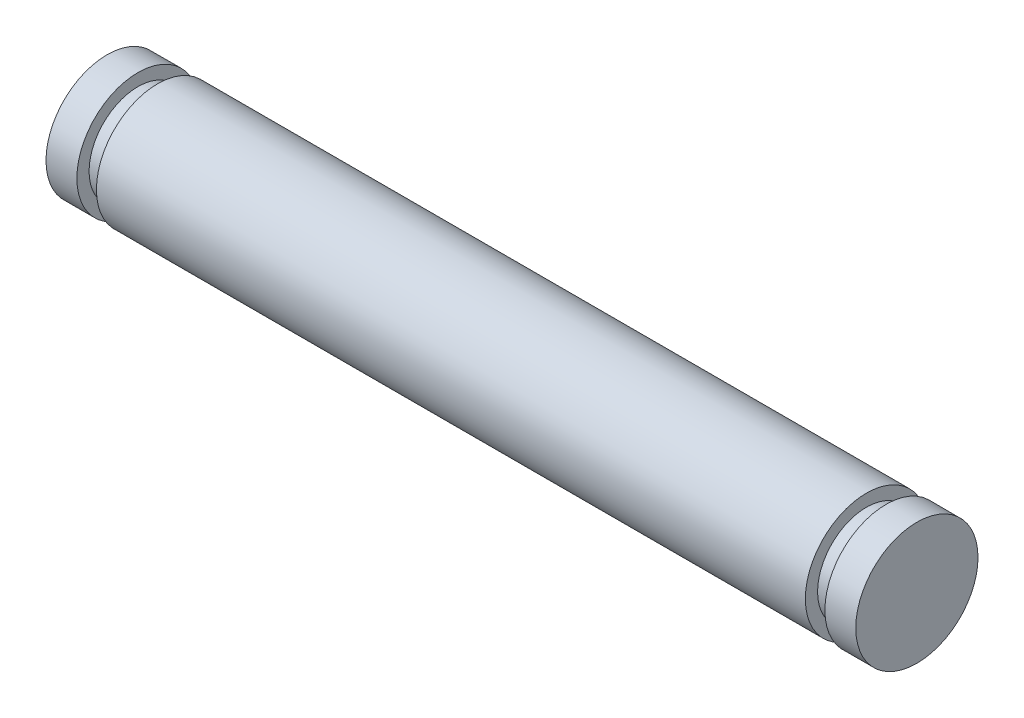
ISO-10303-21;
HEADER;
FILE_DESCRIPTION(('STEP AP214'),'2;1');
FILE_NAME('part.step','',(''),(''),'','','');
FILE_SCHEMA(('AUTOMOTIVE_DESIGN { 1 0 10303 214 1 1 1 1 }'));
ENDSEC;
DATA;
#1=APPLICATION_CONTEXT('core data for automotive mechanical design processes');
#2=APPLICATION_PROTOCOL_DEFINITION('international standard','automotive_design',2000,#1);
#3=PRODUCT_CONTEXT('',#1,'mechanical');
#4=PRODUCT('Part','Part','',(#3));
#5=PRODUCT_RELATED_PRODUCT_CATEGORY('part','',(#4));
#6=PRODUCT_DEFINITION_FORMATION('','',#4);
#7=PRODUCT_DEFINITION_CONTEXT('part definition',#1,'design');
#8=PRODUCT_DEFINITION('design','',#6,#7);
#9=PRODUCT_DEFINITION_SHAPE('','',#8);
#10=(LENGTH_UNIT() NAMED_UNIT(*) SI_UNIT(.MILLI.,.METRE.));
#11=(NAMED_UNIT(*) PLANE_ANGLE_UNIT() SI_UNIT($,.RADIAN.));
#12=(NAMED_UNIT(*) SI_UNIT($,.STERADIAN.) SOLID_ANGLE_UNIT());
#13=UNCERTAINTY_MEASURE_WITH_UNIT(LENGTH_MEASURE(1.E-05),#10,'distance_accuracy_value','');
#14=(GEOMETRIC_REPRESENTATION_CONTEXT(3) GLOBAL_UNCERTAINTY_ASSIGNED_CONTEXT((#13)) GLOBAL_UNIT_ASSIGNED_CONTEXT((#10,
#11,#12)) REPRESENTATION_CONTEXT('',''));
#15=CARTESIAN_POINT('',(0.,0.,0.));
#16=DIRECTION('',(0.,0.,1.));
#17=DIRECTION('',(1.,0.,0.));
#18=AXIS2_PLACEMENT_3D('',#15,#16,#17);
#19=CARTESIAN_POINT('',(13.25,0.,0.));
#20=DIRECTION('',(-1.,0.,0.));
#21=DIRECTION('',(0.,0.,1.));
#22=AXIS2_PLACEMENT_3D('',#19,#20,#21);
#23=CYLINDRICAL_SURFACE('',#22,2.);
#24=CARTESIAN_POINT('',(-11.6,0.,0.));
#25=DIRECTION('',(-1.,0.,0.));
#26=DIRECTION('',(0.,0.,1.));
#27=AXIS2_PLACEMENT_3D('',#24,#25,#26);
#28=CIRCLE('',#27,2.);
#29=CARTESIAN_POINT('',(-11.6,0.,2.));
#30=VERTEX_POINT('',#29);
#31=EDGE_CURVE('E49',#30,#30,#28,.T.);
#32=ORIENTED_EDGE('',*,*,#31,.F.);
#33=EDGE_LOOP('',(#32));
#34=FACE_BOUND('',#33,.T.);
#35=CARTESIAN_POINT('',(11.6,0.,0.));
#36=DIRECTION('',(-1.,0.,0.));
#37=DIRECTION('',(0.,0.,1.));
#38=AXIS2_PLACEMENT_3D('',#35,#36,#37);
#39=CIRCLE('',#38,2.);
#40=CARTESIAN_POINT('',(11.6,0.,2.));
#41=VERTEX_POINT('',#40);
#42=EDGE_CURVE('E61',#41,#41,#39,.T.);
#43=ORIENTED_EDGE('',*,*,#42,.T.);
#44=EDGE_LOOP('',(#43));
#45=FACE_BOUND('',#44,.T.);
#46=ADVANCED_FACE('F31',(#34,#45),#23,.T.);
#47=CARTESIAN_POINT('',(-13.25,0.,0.));
#48=DIRECTION('',(1.,0.,0.));
#49=DIRECTION('',(0.,0.,-1.));
#50=AXIS2_PLACEMENT_3D('',#47,#48,#49);
#51=CIRCLE('',#50,2.);
#52=CARTESIAN_POINT('',(-13.25,0.,-2.));
#53=VERTEX_POINT('',#52);
#54=EDGE_CURVE('E35',#53,#53,#51,.T.);
#55=ORIENTED_EDGE('',*,*,#54,.T.);
#56=EDGE_LOOP('',(#55));
#57=FACE_BOUND('',#56,.T.);
#58=CARTESIAN_POINT('',(-12.24,0.,0.));
#59=DIRECTION('',(-1.,0.,0.));
#60=DIRECTION('',(0.,0.,1.));
#61=AXIS2_PLACEMENT_3D('',#58,#59,#60);
#62=CIRCLE('',#61,2.);
#63=CARTESIAN_POINT('',(-12.24,0.,2.));
#64=VERTEX_POINT('',#63);
#65=EDGE_CURVE('E52',#64,#64,#62,.T.);
#66=ORIENTED_EDGE('',*,*,#65,.T.);
#67=EDGE_LOOP('',(#66));
#68=FACE_BOUND('',#67,.T.);
#69=ADVANCED_FACE('F33',(#57,#68),#23,.T.);
#70=CARTESIAN_POINT('',(-13.25,0.,0.));
#71=DIRECTION('',(1.,0.,0.));
#72=DIRECTION('',(0.,0.,-1.));
#73=AXIS2_PLACEMENT_3D('',#70,#71,#72);
#74=PLANE('',#73);
#75=ORIENTED_EDGE('',*,*,#54,.F.);
#76=EDGE_LOOP('',(#75));
#77=FACE_BOUND('',#76,.T.);
#78=ADVANCED_FACE('F82',(#77),#74,.F.);
#79=CARTESIAN_POINT('',(-12.24,0.,-2.));
#80=DIRECTION('',(1.,0.,0.));
#81=DIRECTION('',(0.,0.,-1.));
#82=AXIS2_PLACEMENT_3D('',#79,#80,#81);
#83=PLANE('',#82);
#84=CARTESIAN_POINT('',(-12.24,0.,0.));
#85=DIRECTION('',(-1.,0.,0.));
#86=DIRECTION('',(0.,0.,1.));
#87=AXIS2_PLACEMENT_3D('',#84,#85,#86);
#88=CIRCLE('',#87,1.6);
#89=CARTESIAN_POINT('',(-12.24,0.,1.6));
#90=VERTEX_POINT('',#89);
#91=EDGE_CURVE('E42',#90,#90,#88,.T.);
#92=ORIENTED_EDGE('',*,*,#91,.T.);
#93=EDGE_LOOP('',(#92));
#94=FACE_BOUND('',#93,.T.);
#95=ORIENTED_EDGE('',*,*,#65,.F.);
#96=EDGE_LOOP('',(#95));
#97=FACE_BOUND('',#96,.T.);
#98=ADVANCED_FACE('F87',(#94,#97),#83,.T.);
#99=CARTESIAN_POINT('',(-14.575,0.,0.));
#100=DIRECTION('',(-1.,0.,0.));
#101=DIRECTION('',(0.,0.,1.));
#102=AXIS2_PLACEMENT_3D('',#99,#100,#101);
#103=CYLINDRICAL_SURFACE('',#102,1.6);
#104=CARTESIAN_POINT('',(-11.6,0.,0.));
#105=DIRECTION('',(-1.,0.,0.));
#106=DIRECTION('',(0.,0.,1.));
#107=AXIS2_PLACEMENT_3D('',#104,#105,#106);
#108=CIRCLE('',#107,1.6);
#109=CARTESIAN_POINT('',(-11.6,0.,1.6));
#110=VERTEX_POINT('',#109);
#111=EDGE_CURVE('E46',#110,#110,#108,.T.);
#112=ORIENTED_EDGE('',*,*,#111,.T.);
#113=EDGE_LOOP('',(#112));
#114=FACE_BOUND('',#113,.T.);
#115=ORIENTED_EDGE('',*,*,#91,.F.);
#116=EDGE_LOOP('',(#115));
#117=FACE_BOUND('',#116,.T.);
#118=ADVANCED_FACE('F94',(#114,#117),#103,.T.);
#119=CARTESIAN_POINT('',(-11.6,0.,-2.));
#120=DIRECTION('',(-1.,0.,0.));
#121=DIRECTION('',(0.,0.,1.));
#122=AXIS2_PLACEMENT_3D('',#119,#120,#121);
#123=PLANE('',#122);
#124=ORIENTED_EDGE('',*,*,#31,.T.);
#125=EDGE_LOOP('',(#124));
#126=FACE_BOUND('',#125,.T.);
#127=ORIENTED_EDGE('',*,*,#111,.F.);
#128=EDGE_LOOP('',(#127));
#129=FACE_BOUND('',#128,.T.);
#130=ADVANCED_FACE('F100',(#126,#129),#123,.T.);
#131=CARTESIAN_POINT('',(12.24,0.,-2.));
#132=DIRECTION('',(-1.,0.,0.));
#133=DIRECTION('',(0.,0.,-1.));
#134=AXIS2_PLACEMENT_3D('',#131,#132,#133);
#135=PLANE('',#134);
#136=CARTESIAN_POINT('',(12.24,0.,0.));
#137=DIRECTION('',(-1.,0.,0.));
#138=DIRECTION('',(0.,0.,1.));
#139=AXIS2_PLACEMENT_3D('',#136,#137,#138);
#140=CIRCLE('',#139,1.6);
#141=CARTESIAN_POINT('',(12.24,0.,1.6));
#142=VERTEX_POINT('',#141);
#143=EDGE_CURVE('E55',#142,#142,#140,.T.);
#144=ORIENTED_EDGE('',*,*,#143,.F.);
#145=EDGE_LOOP('',(#144));
#146=FACE_BOUND('',#145,.T.);
#147=CARTESIAN_POINT('',(12.24,0.,0.));
#148=DIRECTION('',(-1.,0.,0.));
#149=DIRECTION('',(0.,0.,1.));
#150=AXIS2_PLACEMENT_3D('',#147,#148,#149);
#151=CIRCLE('',#150,2.);
#152=CARTESIAN_POINT('',(12.24,0.,2.));
#153=VERTEX_POINT('',#152);
#154=EDGE_CURVE('E64',#153,#153,#151,.T.);
#155=ORIENTED_EDGE('',*,*,#154,.T.);
#156=EDGE_LOOP('',(#155));
#157=FACE_BOUND('',#156,.T.);
#158=ADVANCED_FACE('F68',(#146,#157),#135,.T.);
#159=CARTESIAN_POINT('',(14.575,0.,0.));
#160=DIRECTION('',(1.,0.,0.));
#161=DIRECTION('',(0.,0.,1.));
#162=AXIS2_PLACEMENT_3D('',#159,#160,#161);
#163=CYLINDRICAL_SURFACE('',#162,1.6);
#164=CARTESIAN_POINT('',(11.6,0.,0.));
#165=DIRECTION('',(-1.,0.,0.));
#166=DIRECTION('',(0.,0.,1.));
#167=AXIS2_PLACEMENT_3D('',#164,#165,#166);
#168=CIRCLE('',#167,1.6);
#169=CARTESIAN_POINT('',(11.6,0.,1.6));
#170=VERTEX_POINT('',#169);
#171=EDGE_CURVE('E58',#170,#170,#168,.T.);
#172=ORIENTED_EDGE('',*,*,#171,.F.);
#173=EDGE_LOOP('',(#172));
#174=FACE_BOUND('',#173,.T.);
#175=ORIENTED_EDGE('',*,*,#143,.T.);
#176=EDGE_LOOP('',(#175));
#177=FACE_BOUND('',#176,.T.);
#178=ADVANCED_FACE('F109',(#174,#177),#163,.T.);
#179=CARTESIAN_POINT('',(11.6,0.,-2.));
#180=DIRECTION('',(1.,0.,0.));
#181=DIRECTION('',(0.,0.,1.));
#182=AXIS2_PLACEMENT_3D('',#179,#180,#181);
#183=PLANE('',#182);
#184=ORIENTED_EDGE('',*,*,#42,.F.);
#185=EDGE_LOOP('',(#184));
#186=FACE_BOUND('',#185,.T.);
#187=ORIENTED_EDGE('',*,*,#171,.T.);
#188=EDGE_LOOP('',(#187));
#189=FACE_BOUND('',#188,.T.);
#190=ADVANCED_FACE('F77',(#186,#189),#183,.T.);
#191=CARTESIAN_POINT('',(13.25,0.,0.));
#192=DIRECTION('',(1.,0.,0.));
#193=DIRECTION('',(0.,0.,-1.));
#194=AXIS2_PLACEMENT_3D('',#191,#192,#193);
#195=PLANE('',#194);
#196=CARTESIAN_POINT('',(13.25,0.,0.));
#197=DIRECTION('',(1.,0.,0.));
#198=DIRECTION('',(0.,0.,-1.));
#199=AXIS2_PLACEMENT_3D('',#196,#197,#198);
#200=CIRCLE('',#199,2.);
#201=CARTESIAN_POINT('',(13.25,0.,-2.));
#202=VERTEX_POINT('',#201);
#203=EDGE_CURVE('E10',#202,#202,#200,.T.);
#204=ORIENTED_EDGE('',*,*,#203,.T.);
#205=EDGE_LOOP('',(#204));
#206=FACE_BOUND('',#205,.T.);
#207=ADVANCED_FACE('F72',(#206),#195,.T.);
#208=ORIENTED_EDGE('',*,*,#203,.F.);
#209=EDGE_LOOP('',(#208));
#210=FACE_BOUND('',#209,.T.);
#211=ORIENTED_EDGE('',*,*,#154,.F.);
#212=EDGE_LOOP('',(#211));
#213=FACE_BOUND('',#212,.T.);
#214=ADVANCED_FACE('F70',(#210,#213),#23,.T.);
#215=CLOSED_SHELL('',(#46,#69,#78,#98,#118,#130,#158,#178,#190,#207,#214));
#216=MANIFOLD_SOLID_BREP('B2',#215);
#217=ADVANCED_BREP_SHAPE_REPRESENTATION('',(#18,#216),#14);
#218=SHAPE_DEFINITION_REPRESENTATION(#9,#217);
ENDSEC;
END-ISO-10303-21;
